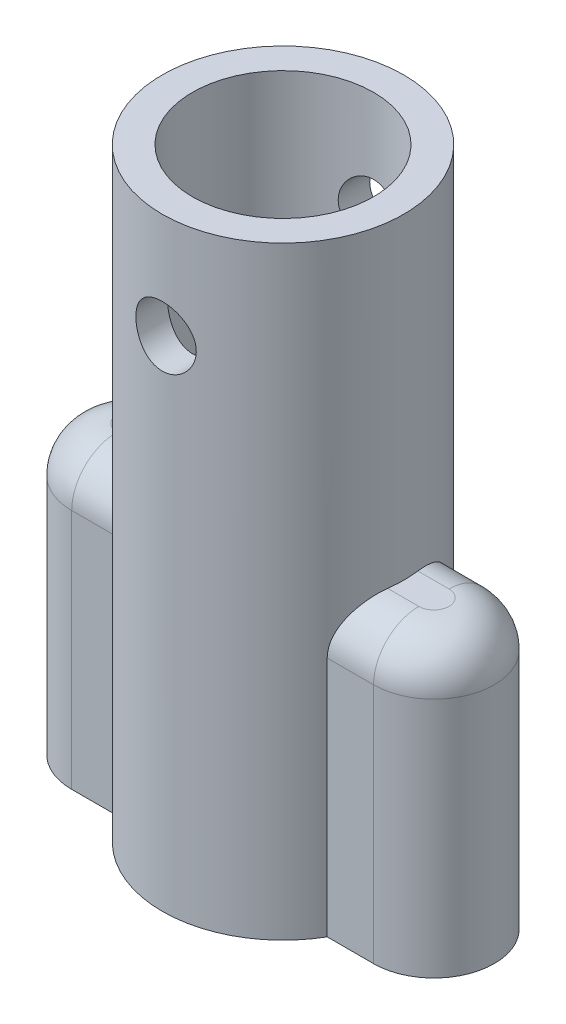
ISO-10303-21;
HEADER;
FILE_DESCRIPTION(('STEP AP214'),'2;1');
FILE_NAME('part.step','',(''),(''),'','','');
FILE_SCHEMA(('AUTOMOTIVE_DESIGN { 1 0 10303 214 1 1 1 1 }'));
ENDSEC;
DATA;
#1=APPLICATION_CONTEXT('core data for automotive mechanical design processes');
#2=APPLICATION_PROTOCOL_DEFINITION('international standard','automotive_design',2000,#1);
#3=PRODUCT_CONTEXT('',#1,'mechanical');
#4=PRODUCT('Part','Part','',(#3));
#5=PRODUCT_RELATED_PRODUCT_CATEGORY('part','',(#4));
#6=PRODUCT_DEFINITION_FORMATION('','',#4);
#7=PRODUCT_DEFINITION_CONTEXT('part definition',#1,'design');
#8=PRODUCT_DEFINITION('design','',#6,#7);
#9=PRODUCT_DEFINITION_SHAPE('','',#8);
#10=(LENGTH_UNIT() NAMED_UNIT(*) SI_UNIT(.MILLI.,.METRE.));
#11=(NAMED_UNIT(*) PLANE_ANGLE_UNIT() SI_UNIT($,.RADIAN.));
#12=(NAMED_UNIT(*) SI_UNIT($,.STERADIAN.) SOLID_ANGLE_UNIT());
#13=UNCERTAINTY_MEASURE_WITH_UNIT(LENGTH_MEASURE(1.E-05),#10,'distance_accuracy_value','');
#14=(GEOMETRIC_REPRESENTATION_CONTEXT(3) GLOBAL_UNCERTAINTY_ASSIGNED_CONTEXT((#13)) GLOBAL_UNIT_ASSIGNED_CONTEXT((#10,
#11,#12)) REPRESENTATION_CONTEXT('',''));
#15=CARTESIAN_POINT('',(0.,0.,0.));
#16=DIRECTION('',(0.,0.,1.));
#17=DIRECTION('',(1.,0.,0.));
#18=AXIS2_PLACEMENT_3D('',#15,#16,#17);
#19=CARTESIAN_POINT('',(0.,16.,0.));
#20=DIRECTION('',(0.,1.,0.));
#21=DIRECTION('',(0.,0.,1.));
#22=AXIS2_PLACEMENT_3D('',#19,#20,#21);
#23=PLANE('',#22);
#24=CARTESIAN_POINT('',(-10.5,16.,0.));
#25=DIRECTION('',(0.,1.,0.));
#26=DIRECTION('',(0.,0.,1.));
#27=AXIS2_PLACEMENT_3D('',#24,#25,#26);
#28=CIRCLE('',#27,1.65);
#29=CARTESIAN_POINT('',(-10.5,16.,1.65));
#30=VERTEX_POINT('',#29);
#31=EDGE_CURVE('E20',#30,#30,#28,.F.);
#32=ORIENTED_EDGE('',*,*,#31,.T.);
#33=EDGE_LOOP('',(#32));
#34=FACE_BOUND('',#33,.T.);
#35=ADVANCED_FACE('F16',(#34),#23,.F.);
#36=CARTESIAN_POINT('',(0.,16.,0.));
#37=DIRECTION('',(0.,1.,0.));
#38=DIRECTION('',(0.,0.,1.));
#39=AXIS2_PLACEMENT_3D('',#36,#37,#38);
#40=PLANE('',#39);
#41=CARTESIAN_POINT('',(10.5,16.,0.));
#42=DIRECTION('',(0.,1.,0.));
#43=DIRECTION('',(0.,0.,1.));
#44=AXIS2_PLACEMENT_3D('',#41,#42,#43);
#45=CIRCLE('',#44,1.65);
#46=CARTESIAN_POINT('',(10.5,16.,1.65));
#47=VERTEX_POINT('',#46);
#48=EDGE_CURVE('E154',#47,#47,#45,.F.);
#49=ORIENTED_EDGE('',*,*,#48,.T.);
#50=EDGE_LOOP('',(#49));
#51=FACE_BOUND('',#50,.T.);
#52=ADVANCED_FACE('F385',(#51),#40,.F.);
#53=CARTESIAN_POINT('',(10.0000000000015,16.0000000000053,7.55038392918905E-13));
#54=DIRECTION('',(0.,1.,0.));
#55=DIRECTION('',(0.,0.,1.));
#56=AXIS2_PLACEMENT_3D('',#53,#54,#55);
#57=DEGENERATE_TOROIDAL_SURFACE('',#56,1.00000000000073,2.99999999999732,.T.);
#58=CARTESIAN_POINT('',(10.,16.,0.));
#59=DIRECTION('',(0.,1.,0.));
#60=DIRECTION('',(0.,0.,1.));
#61=AXIS2_PLACEMENT_3D('',#58,#59,#60);
#62=CIRCLE('',#61,4.);
#63=CARTESIAN_POINT('',(9.99999999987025,16.,-4.));
#64=VERTEX_POINT('',#63);
#65=CARTESIAN_POINT('',(10.,16.,4.));
#66=VERTEX_POINT('',#65);
#67=EDGE_CURVE('E107',#64,#66,#62,.F.);
#68=ORIENTED_EDGE('',*,*,#67,.F.);
#69=CARTESIAN_POINT('',(10.,16.,-1.));
#70=DIRECTION('',(-1.,0.,0.));
#71=DIRECTION('',(0.,0.,1.));
#72=AXIS2_PLACEMENT_3D('',#69,#70,#71);
#73=CIRCLE('',#72,3.);
#74=CARTESIAN_POINT('',(10.0000000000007,19.0000000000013,-1.));
#75=VERTEX_POINT('',#74);
#76=EDGE_CURVE('E119',#75,#64,#73,.T.);
#77=ORIENTED_EDGE('',*,*,#76,.F.);
#78=CARTESIAN_POINT('',(10.0000000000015,19.0000000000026,7.5926825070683E-13));
#79=DIRECTION('',(0.,1.,0.));
#80=DIRECTION('',(0.,0.,1.));
#81=AXIS2_PLACEMENT_3D('',#78,#79,#80);
#82=CIRCLE('',#81,1.00000000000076);
#83=CARTESIAN_POINT('',(10.0000000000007,19.0000000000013,1.));
#84=VERTEX_POINT('',#83);
#85=EDGE_CURVE('E293',#84,#75,#82,.T.);
#86=ORIENTED_EDGE('',*,*,#85,.F.);
#87=CARTESIAN_POINT('',(10.,16.,1.));
#88=DIRECTION('',(1.,0.,0.));
#89=DIRECTION('',(0.,0.,-1.));
#90=AXIS2_PLACEMENT_3D('',#87,#88,#89);
#91=CIRCLE('',#90,3.);
#92=EDGE_CURVE('E100',#66,#84,#91,.F.);
#93=ORIENTED_EDGE('',*,*,#92,.F.);
#94=EDGE_LOOP('',(#68,#77,#86,#93));
#95=FACE_BOUND('',#94,.T.);
#96=ADVANCED_FACE('F118',(#95),#57,.T.);
#97=CARTESIAN_POINT('',(-10.0000000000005,16.0000000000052,3.31765864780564E-13));
#98=DIRECTION('',(0.,1.,0.));
#99=DIRECTION('',(0.,0.,1.));
#100=AXIS2_PLACEMENT_3D('',#97,#98,#99);
#101=DEGENERATE_TOROIDAL_SURFACE('',#100,1.00000000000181,2.99999999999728,.T.);
#102=CARTESIAN_POINT('',(-10.,16.,0.));
#103=DIRECTION('',(0.,1.,0.));
#104=DIRECTION('',(0.,0.,1.));
#105=AXIS2_PLACEMENT_3D('',#102,#103,#104);
#106=CIRCLE('',#105,4.);
#107=CARTESIAN_POINT('',(-10.,16.,4.));
#108=VERTEX_POINT('',#107);
#109=CARTESIAN_POINT('',(-10.,16.,-4.));
#110=VERTEX_POINT('',#109);
#111=EDGE_CURVE('E113',#108,#110,#106,.F.);
#112=ORIENTED_EDGE('',*,*,#111,.F.);
#113=CARTESIAN_POINT('',(-10.,16.,1.));
#114=DIRECTION('',(1.,0.,0.));
#115=DIRECTION('',(0.,0.,-1.));
#116=AXIS2_PLACEMENT_3D('',#113,#114,#115);
#117=CIRCLE('',#116,3.);
#118=CARTESIAN_POINT('',(-10.0000000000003,19.0000000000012,1.));
#119=VERTEX_POINT('',#118);
#120=EDGE_CURVE('E163',#119,#108,#117,.T.);
#121=ORIENTED_EDGE('',*,*,#120,.F.);
#122=CARTESIAN_POINT('',(-10.0000000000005,19.0000000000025,3.27536006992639E-13));
#123=DIRECTION('',(0.,1.,0.));
#124=DIRECTION('',(0.,0.,1.));
#125=AXIS2_PLACEMENT_3D('',#122,#123,#124);
#126=CIRCLE('',#125,0.999999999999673);
#127=CARTESIAN_POINT('',(-10.0000000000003,19.0000000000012,-1.));
#128=VERTEX_POINT('',#127);
#129=EDGE_CURVE('E291',#128,#119,#126,.T.);
#130=ORIENTED_EDGE('',*,*,#129,.F.);
#131=CARTESIAN_POINT('',(-10.,16.,-1.));
#132=DIRECTION('',(-1.,0.,0.));
#133=DIRECTION('',(0.,0.,1.));
#134=AXIS2_PLACEMENT_3D('',#131,#132,#133);
#135=CIRCLE('',#134,3.);
#136=EDGE_CURVE('E167',#110,#128,#135,.F.);
#137=ORIENTED_EDGE('',*,*,#136,.F.);
#138=EDGE_LOOP('',(#112,#121,#130,#137));
#139=FACE_BOUND('',#138,.T.);
#140=ADVANCED_FACE('F18',(#139),#101,.T.);
#141=CARTESIAN_POINT('',(10.,0.,0.));
#142=DIRECTION('',(0.,1.,0.));
#143=DIRECTION('',(0.,0.,1.));
#144=AXIS2_PLACEMENT_3D('',#141,#142,#143);
#145=CYLINDRICAL_SURFACE('',#144,4.);
#146=CARTESIAN_POINT('',(10.,0.,0.));
#147=DIRECTION('',(0.,1.,0.));
#148=DIRECTION('',(0.,0.,1.));
#149=AXIS2_PLACEMENT_3D('',#146,#147,#148);
#150=CIRCLE('',#149,4.);
#151=CARTESIAN_POINT('',(10.,0.,4.));
#152=VERTEX_POINT('',#151);
#153=CARTESIAN_POINT('',(9.9999999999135,0.,-4.));
#154=VERTEX_POINT('',#153);
#155=EDGE_CURVE('E134',#152,#154,#150,.T.);
#156=ORIENTED_EDGE('',*,*,#155,.T.);
#157=DIRECTION('',(0.,1.,0.));
#158=VECTOR('',#157,1.);
#159=CARTESIAN_POINT('',(9.999999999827,0.,-4.));
#160=LINE('',#159,#158);
#161=EDGE_CURVE('E131',#64,#154,#160,.F.);
#162=ORIENTED_EDGE('',*,*,#161,.F.);
#163=ORIENTED_EDGE('',*,*,#67,.T.);
#164=DIRECTION('',(0.,1.,0.));
#165=VECTOR('',#164,1.);
#166=CARTESIAN_POINT('',(10.,0.,4.));
#167=LINE('',#166,#165);
#168=EDGE_CURVE('E151',#152,#66,#167,.T.);
#169=ORIENTED_EDGE('',*,*,#168,.F.);
#170=EDGE_LOOP('',(#156,#162,#163,#169));
#171=FACE_BOUND('',#170,.T.);
#172=ADVANCED_FACE('F132',(#171),#145,.T.);
#173=CARTESIAN_POINT('',(-10.,0.,0.));
#174=DIRECTION('',(0.,1.,0.));
#175=DIRECTION('',(0.,0.,1.));
#176=AXIS2_PLACEMENT_3D('',#173,#174,#175);
#177=CYLINDRICAL_SURFACE('',#176,4.);
#178=CARTESIAN_POINT('',(-10.,0.,0.));
#179=DIRECTION('',(0.,1.,0.));
#180=DIRECTION('',(0.,0.,1.));
#181=AXIS2_PLACEMENT_3D('',#178,#179,#180);
#182=CIRCLE('',#181,4.);
#183=CARTESIAN_POINT('',(-10.,0.,-4.));
#184=VERTEX_POINT('',#183);
#185=CARTESIAN_POINT('',(-10.,0.,4.));
#186=VERTEX_POINT('',#185);
#187=EDGE_CURVE('E284',#184,#186,#182,.T.);
#188=ORIENTED_EDGE('',*,*,#187,.T.);
#189=DIRECTION('',(0.,1.,0.));
#190=VECTOR('',#189,1.);
#191=CARTESIAN_POINT('',(-10.,0.,4.));
#192=LINE('',#191,#190);
#193=EDGE_CURVE('E289',#108,#186,#192,.F.);
#194=ORIENTED_EDGE('',*,*,#193,.F.);
#195=ORIENTED_EDGE('',*,*,#111,.T.);
#196=DIRECTION('',(0.,1.,0.));
#197=VECTOR('',#196,1.);
#198=CARTESIAN_POINT('',(-10.,0.,-4.));
#199=LINE('',#198,#197);
#200=EDGE_CURVE('E138',#184,#110,#199,.T.);
#201=ORIENTED_EDGE('',*,*,#200,.F.);
#202=EDGE_LOOP('',(#188,#194,#195,#201));
#203=FACE_BOUND('',#202,.T.);
#204=ADVANCED_FACE('F374',(#203),#177,.T.);
#205=CARTESIAN_POINT('',(-10.5,0.,0.));
#206=DIRECTION('',(0.,1.,0.));
#207=DIRECTION('',(0.,0.,1.));
#208=AXIS2_PLACEMENT_3D('',#205,#206,#207);
#209=CYLINDRICAL_SURFACE('',#208,1.65);
#210=ORIENTED_EDGE('',*,*,#31,.F.);
#211=EDGE_LOOP('',(#210));
#212=FACE_BOUND('',#211,.T.);
#213=CARTESIAN_POINT('',(-10.5,0.,0.));
#214=DIRECTION('',(0.,1.,0.));
#215=DIRECTION('',(0.,0.,1.));
#216=AXIS2_PLACEMENT_3D('',#213,#214,#215);
#217=CIRCLE('',#216,1.65);
#218=CARTESIAN_POINT('',(-10.5,0.,1.65));
#219=VERTEX_POINT('',#218);
#220=EDGE_CURVE('E277',#219,#219,#217,.F.);
#221=ORIENTED_EDGE('',*,*,#220,.T.);
#222=EDGE_LOOP('',(#221));
#223=FACE_BOUND('',#222,.T.);
#224=ADVANCED_FACE('F372',(#212,#223),#209,.F.);
#225=CARTESIAN_POINT('',(10.5,0.,0.));
#226=DIRECTION('',(0.,1.,0.));
#227=DIRECTION('',(0.,0.,1.));
#228=AXIS2_PLACEMENT_3D('',#225,#226,#227);
#229=CYLINDRICAL_SURFACE('',#228,1.65);
#230=ORIENTED_EDGE('',*,*,#48,.F.);
#231=EDGE_LOOP('',(#230));
#232=FACE_BOUND('',#231,.T.);
#233=CARTESIAN_POINT('',(10.5,0.,0.));
#234=DIRECTION('',(0.,1.,0.));
#235=DIRECTION('',(0.,0.,1.));
#236=AXIS2_PLACEMENT_3D('',#233,#234,#235);
#237=CIRCLE('',#236,1.65);
#238=CARTESIAN_POINT('',(10.5,0.,1.65));
#239=VERTEX_POINT('',#238);
#240=EDGE_CURVE('E275',#239,#239,#237,.F.);
#241=ORIENTED_EDGE('',*,*,#240,.T.);
#242=EDGE_LOOP('',(#241));
#243=FACE_BOUND('',#242,.T.);
#244=ADVANCED_FACE('F253',(#232,#243),#229,.F.);
#245=CARTESIAN_POINT('',(0.,0.,0.));
#246=DIRECTION('',(0.,1.,0.));
#247=DIRECTION('',(0.,0.,1.));
#248=AXIS2_PLACEMENT_3D('',#245,#246,#247);
#249=CYLINDRICAL_SURFACE('',#248,6.);
#250=CARTESIAN_POINT('',(0.,31.,6.));
#251=CARTESIAN_POINT('',(0.109051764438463,31.0000045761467,5.99999668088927));
#252=CARTESIAN_POINT('',(0.218157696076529,31.0089549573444,5.99699676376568));
#253=CARTESIAN_POINT('',(0.433211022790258,31.0444365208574,5.985311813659));
#254=CARTESIAN_POINT('',(0.539155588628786,31.0709829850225,5.97662183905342));
#255=CARTESIAN_POINT('',(0.744671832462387,31.1406417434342,5.95450498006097));
#256=CARTESIAN_POINT('',(0.844255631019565,31.1837213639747,5.94108744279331));
#257=CARTESIAN_POINT('',(1.03476566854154,31.2850920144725,5.91088618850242));
#258=CARTESIAN_POINT('',(1.12569163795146,31.343383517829,5.894102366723));
#259=CARTESIAN_POINT('',(1.29947472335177,31.4756450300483,5.85828360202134));
#260=CARTESIAN_POINT('',(1.38199150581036,31.5500475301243,5.83919475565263));
#261=CARTESIAN_POINT('',(1.53365228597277,31.7115183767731,5.80120993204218));
#262=CARTESIAN_POINT('',(1.60279077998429,31.7985919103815,5.78231403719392));
#263=CARTESIAN_POINT('',(1.72767937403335,31.9860121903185,5.74625797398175));
#264=CARTESIAN_POINT('',(1.78298064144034,32.0866717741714,5.72916442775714));
#265=CARTESIAN_POINT('',(1.87567434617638,32.2964659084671,5.69949444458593));
#266=CARTESIAN_POINT('',(1.91308899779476,32.4055897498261,5.68691240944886));
#267=CARTESIAN_POINT('',(1.96045323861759,32.5960032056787,5.6707175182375));
#268=CARTESIAN_POINT('',(1.9752520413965,32.6759867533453,5.6655528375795));
#269=CARTESIAN_POINT('',(1.99502673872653,32.8373034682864,5.65861982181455));
#270=CARTESIAN_POINT('',(2.00000352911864,32.9186365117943,5.65685117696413));
#271=CARTESIAN_POINT('',(1.99999527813,33.1088622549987,5.65685836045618));
#272=CARTESIAN_POINT('',(1.9910749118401,33.2177790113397,5.66003415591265));
#273=CARTESIAN_POINT('',(1.95572343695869,33.4324385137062,5.67234347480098));
#274=CARTESIAN_POINT('',(1.92927636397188,33.5381782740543,5.68148242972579));
#275=CARTESIAN_POINT('',(1.85990780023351,33.7432597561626,5.7045653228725));
#276=CARTESIAN_POINT('',(1.81702344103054,33.8426153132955,5.71849842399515));
#277=CARTESIAN_POINT('',(1.71611391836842,34.032735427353,5.74958512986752));
#278=CARTESIAN_POINT('',(1.65808785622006,34.123499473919,5.76673892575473));
#279=CARTESIAN_POINT('',(1.5261088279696,34.2974313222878,5.80308805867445));
#280=CARTESIAN_POINT('',(1.45166352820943,34.3802150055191,5.82233425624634));
#281=CARTESIAN_POINT('',(1.28999121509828,34.5324005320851,5.86027372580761));
#282=CARTESIAN_POINT('',(1.20275973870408,34.601797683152,5.87896680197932));
#283=CARTESIAN_POINT('',(1.01516764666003,34.726986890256,5.91428567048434));
#284=CARTESIAN_POINT('',(0.914520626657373,34.7823702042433,5.93084364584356));
#285=CARTESIAN_POINT('',(0.704750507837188,34.8752193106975,5.95940282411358));
#286=CARTESIAN_POINT('',(0.595637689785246,34.9127064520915,5.97140945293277));
#287=CARTESIAN_POINT('',(0.405039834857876,34.9602477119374,5.98683882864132));
#288=CARTESIAN_POINT('',(0.324845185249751,34.9751241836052,5.99174666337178));
#289=CARTESIAN_POINT('',(0.163110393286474,34.995001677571,5.99832837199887));
#290=CARTESIAN_POINT('',(0.0815703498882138,35.0000034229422,6.00000248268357));
#291=CARTESIAN_POINT('',(-0.109051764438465,34.9999954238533,5.99999668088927));
#292=CARTESIAN_POINT('',(-0.218157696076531,34.9910450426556,5.99699676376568));
#293=CARTESIAN_POINT('',(-0.433211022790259,34.9555634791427,5.985311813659));
#294=CARTESIAN_POINT('',(-0.539155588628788,34.9290170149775,5.97662183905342));
#295=CARTESIAN_POINT('',(-0.744671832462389,34.8593582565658,5.95450498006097));
#296=CARTESIAN_POINT('',(-0.844255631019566,34.8162786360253,5.94108744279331));
#297=CARTESIAN_POINT('',(-1.03476566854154,34.7149079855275,5.91088618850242));
#298=CARTESIAN_POINT('',(-1.12569163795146,34.656616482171,5.894102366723));
#299=CARTESIAN_POINT('',(-1.29947472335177,34.5243549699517,5.85828360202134));
#300=CARTESIAN_POINT('',(-1.38199150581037,34.4499524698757,5.83919475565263));
#301=CARTESIAN_POINT('',(-1.53365228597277,34.2884816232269,5.80120993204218));
#302=CARTESIAN_POINT('',(-1.60279077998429,34.2014080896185,5.78231403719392));
#303=CARTESIAN_POINT('',(-1.72767937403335,34.0139878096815,5.74625797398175));
#304=CARTESIAN_POINT('',(-1.78298064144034,33.9133282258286,5.72916442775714));
#305=CARTESIAN_POINT('',(-1.87567434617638,33.7035340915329,5.69949444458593));
#306=CARTESIAN_POINT('',(-1.91308899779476,33.5944102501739,5.68691240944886));
#307=CARTESIAN_POINT('',(-1.96045323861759,33.4039967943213,5.6707175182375));
#308=CARTESIAN_POINT('',(-1.9752520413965,33.3240132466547,5.6655528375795));
#309=CARTESIAN_POINT('',(-1.99502673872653,33.1626965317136,5.65861982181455));
#310=CARTESIAN_POINT('',(-2.00000352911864,33.0813634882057,5.65685117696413));
#311=CARTESIAN_POINT('',(-1.99999527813,32.8911377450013,5.65685836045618));
#312=CARTESIAN_POINT('',(-1.9910749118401,32.7822209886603,5.66003415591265));
#313=CARTESIAN_POINT('',(-1.95572343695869,32.5675614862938,5.67234347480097));
#314=CARTESIAN_POINT('',(-1.92927636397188,32.4618217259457,5.68148242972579));
#315=CARTESIAN_POINT('',(-1.85990780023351,32.2567402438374,5.7045653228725));
#316=CARTESIAN_POINT('',(-1.81702344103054,32.1573846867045,5.71849842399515));
#317=CARTESIAN_POINT('',(-1.71611391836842,31.967264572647,5.74958512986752));
#318=CARTESIAN_POINT('',(-1.65808785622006,31.876500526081,5.76673892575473));
#319=CARTESIAN_POINT('',(-1.5261088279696,31.7025686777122,5.80308805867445));
#320=CARTESIAN_POINT('',(-1.45166352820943,31.6197849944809,5.82233425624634));
#321=CARTESIAN_POINT('',(-1.28999121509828,31.4675994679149,5.86027372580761));
#322=CARTESIAN_POINT('',(-1.20275973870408,31.398202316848,5.87896680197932));
#323=CARTESIAN_POINT('',(-1.01516764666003,31.273013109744,5.91428567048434));
#324=CARTESIAN_POINT('',(-0.914520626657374,31.2176297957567,5.93084364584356));
#325=CARTESIAN_POINT('',(-0.704750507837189,31.1247806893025,5.95940282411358));
#326=CARTESIAN_POINT('',(-0.595637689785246,31.0872935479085,5.97140945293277));
#327=CARTESIAN_POINT('',(-0.405039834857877,31.0397522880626,5.98683882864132));
#328=CARTESIAN_POINT('',(-0.324845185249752,31.0248758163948,5.99174666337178));
#329=CARTESIAN_POINT('',(-0.163110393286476,31.004998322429,5.99832837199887));
#330=CARTESIAN_POINT('',(-0.0815703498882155,30.9999965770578,6.00000248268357));
#331=CARTESIAN_POINT('',(0.,31.,6.));
#332=B_SPLINE_CURVE_WITH_KNOTS('',3,(#250,#251,#252,#253,#254,#255,#256,#257,#258,#259,#260,
#261,#262,#263,#264,#265,#266,#267,#268,#269,#270,#271,#272,#273,#274,#275,#276,#277,#278,#279,
#280,#281,#282,#283,#284,#285,#286,#287,#288,#289,#290,#291,#292,#293,#294,#295,#296,#297,#298,
#299,#300,#301,#302,#303,#304,#305,#306,#307,#308,#309,#310,#311,#312,#313,#314,#315,#316,#317,
#318,#319,#320,#321,#322,#323,#324,#325,#326,#327,#328,#329,#330,#331),.UNSPECIFIED.,.T.,.F.,(4,
2,2,2,2,2,2,2,2,2,2,2,2,2,2,2,2,2,2,2,2,2,2,2,2,2,2,2,2,2,2,2,2,2,2,2,2,2,2,2,4),(0.,
0.326849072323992,0.653982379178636,0.980472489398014,1.30697276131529,1.64366160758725,
1.98048867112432,2.32713061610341,2.67334092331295,2.91722380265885,3.16108443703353,
3.48736369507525,3.81394055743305,4.13978399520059,4.46564677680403,4.80307923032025,
5.14062974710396,5.4871150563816,5.83318599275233,6.07768589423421,6.32216789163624,
6.64901696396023,6.97615027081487,7.30264038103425,7.62914065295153,7.96582949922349,
8.30265656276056,8.64929850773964,8.99550881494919,9.23939169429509,9.48325232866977,
9.80953158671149,10.1361084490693,10.4619518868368,10.7878146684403,11.1252471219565,
11.4627976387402,11.8092829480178,12.1553538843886,12.3998537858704,12.6443357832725),.UNSPECIFIED.);
#333=CARTESIAN_POINT('',(0.,31.,6.));
#334=VERTEX_POINT('',#333);
#335=EDGE_CURVE('E237',#334,#334,#332,.T.);
#336=ORIENTED_EDGE('',*,*,#335,.T.);
#337=EDGE_LOOP('',(#336));
#338=FACE_BOUND('',#337,.T.);
#339=CARTESIAN_POINT('',(0.,40.,0.));
#340=DIRECTION('',(0.,1.,0.));
#341=DIRECTION('',(0.,0.,1.));
#342=AXIS2_PLACEMENT_3D('',#339,#340,#341);
#343=CIRCLE('',#342,6.);
#344=CARTESIAN_POINT('',(0.,40.,6.));
#345=VERTEX_POINT('',#344);
#346=EDGE_CURVE('E244',#345,#345,#343,.F.);
#347=ORIENTED_EDGE('',*,*,#346,.F.);
#348=EDGE_LOOP('',(#347));
#349=FACE_BOUND('',#348,.T.);
#350=CARTESIAN_POINT('',(2.,33.,-5.65685424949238));
#351=CARTESIAN_POINT('',(1.99999527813,32.8911377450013,-5.65685836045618));
#352=CARTESIAN_POINT('',(1.9910749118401,32.7822209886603,-5.66003415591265));
#353=CARTESIAN_POINT('',(1.95572343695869,32.5675614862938,-5.67234347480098));
#354=CARTESIAN_POINT('',(1.92927636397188,32.4618217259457,-5.68148242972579));
#355=CARTESIAN_POINT('',(1.85990780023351,32.2567402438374,-5.7045653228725));
#356=CARTESIAN_POINT('',(1.81702344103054,32.1573846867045,-5.71849842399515));
#357=CARTESIAN_POINT('',(1.71611391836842,31.967264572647,-5.74958512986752));
#358=CARTESIAN_POINT('',(1.65808785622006,31.876500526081,-5.76673892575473));
#359=CARTESIAN_POINT('',(1.5261088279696,31.7025686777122,-5.80308805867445));
#360=CARTESIAN_POINT('',(1.45166352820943,31.6197849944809,-5.82233425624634));
#361=CARTESIAN_POINT('',(1.28999121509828,31.4675994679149,-5.86027372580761));
#362=CARTESIAN_POINT('',(1.20275973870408,31.398202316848,-5.87896680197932));
#363=CARTESIAN_POINT('',(1.01516764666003,31.273013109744,-5.91428567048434));
#364=CARTESIAN_POINT('',(0.914520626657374,31.2176297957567,-5.93084364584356));
#365=CARTESIAN_POINT('',(0.704750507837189,31.1247806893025,-5.95940282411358));
#366=CARTESIAN_POINT('',(0.595637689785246,31.0872935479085,-5.97140945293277));
#367=CARTESIAN_POINT('',(0.405039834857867,31.0397522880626,-5.98683882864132));
#368=CARTESIAN_POINT('',(0.324845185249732,31.0248758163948,-5.99174666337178));
#369=CARTESIAN_POINT('',(0.163110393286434,31.004998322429,-5.99832837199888));
#370=CARTESIAN_POINT('',(0.0815703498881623,30.9999965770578,-6.00000248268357));
#371=CARTESIAN_POINT('',(-0.109051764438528,31.0000045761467,-5.99999668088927));
#372=CARTESIAN_POINT('',(-0.218157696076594,31.0089549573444,-5.99699676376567));
#373=CARTESIAN_POINT('',(-0.433211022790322,31.0444365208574,-5.985311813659));
#374=CARTESIAN_POINT('',(-0.53915558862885,31.0709829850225,-5.97662183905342));
#375=CARTESIAN_POINT('',(-0.74467183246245,31.1406417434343,-5.95450498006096));
#376=CARTESIAN_POINT('',(-0.844255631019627,31.1837213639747,-5.9410874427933));
#377=CARTESIAN_POINT('',(-1.0347656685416,31.2850920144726,-5.91088618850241));
#378=CARTESIAN_POINT('',(-1.12569163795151,31.3433835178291,-5.89410236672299));
#379=CARTESIAN_POINT('',(-1.29947472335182,31.4756450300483,-5.85828360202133));
#380=CARTESIAN_POINT('',(-1.38199150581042,31.5500475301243,-5.83919475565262));
#381=CARTESIAN_POINT('',(-1.53365228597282,31.7115183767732,-5.80120993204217));
#382=CARTESIAN_POINT('',(-1.60279077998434,31.7985919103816,-5.78231403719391));
#383=CARTESIAN_POINT('',(-1.72767937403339,31.9860121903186,-5.74625797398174));
#384=CARTESIAN_POINT('',(-1.78298064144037,32.0866717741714,-5.72916442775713));
#385=CARTESIAN_POINT('',(-1.87567434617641,32.2964659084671,-5.69949444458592));
#386=CARTESIAN_POINT('',(-1.91308899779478,32.4055897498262,-5.68691240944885));
#387=CARTESIAN_POINT('',(-1.9604532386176,32.5960032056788,-5.6707175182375));
#388=CARTESIAN_POINT('',(-1.97525204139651,32.6759867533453,-5.6655528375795));
#389=CARTESIAN_POINT('',(-1.99502673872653,32.8373034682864,-5.65861982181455));
#390=CARTESIAN_POINT('',(-2.00000352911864,32.9186365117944,-5.65685117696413));
#391=CARTESIAN_POINT('',(-1.99999527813,33.1088622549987,-5.65685836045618));
#392=CARTESIAN_POINT('',(-1.9910749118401,33.2177790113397,-5.66003415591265));
#393=CARTESIAN_POINT('',(-1.95572343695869,33.4324385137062,-5.67234347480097));
#394=CARTESIAN_POINT('',(-1.92927636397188,33.5381782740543,-5.68148242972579));
#395=CARTESIAN_POINT('',(-1.85990780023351,33.7432597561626,-5.7045653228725));
#396=CARTESIAN_POINT('',(-1.81702344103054,33.8426153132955,-5.71849842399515));
#397=CARTESIAN_POINT('',(-1.71611391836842,34.032735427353,-5.74958512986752));
#398=CARTESIAN_POINT('',(-1.65808785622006,34.123499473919,-5.76673892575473));
#399=CARTESIAN_POINT('',(-1.5261088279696,34.2974313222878,-5.80308805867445));
#400=CARTESIAN_POINT('',(-1.45166352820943,34.3802150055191,-5.82233425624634));
#401=CARTESIAN_POINT('',(-1.28999121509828,34.5324005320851,-5.86027372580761));
#402=CARTESIAN_POINT('',(-1.20275973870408,34.601797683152,-5.87896680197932));
#403=CARTESIAN_POINT('',(-1.01516764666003,34.726986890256,-5.91428567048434));
#404=CARTESIAN_POINT('',(-0.914520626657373,34.7823702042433,-5.93084364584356));
#405=CARTESIAN_POINT('',(-0.704750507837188,34.8752193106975,-5.95940282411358));
#406=CARTESIAN_POINT('',(-0.595637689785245,34.9127064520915,-5.97140945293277));
#407=CARTESIAN_POINT('',(-0.405039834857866,34.9602477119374,-5.98683882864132));
#408=CARTESIAN_POINT('',(-0.324845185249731,34.9751241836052,-5.99174666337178));
#409=CARTESIAN_POINT('',(-0.163110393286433,34.9950016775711,-5.99832837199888));
#410=CARTESIAN_POINT('',(-0.0815703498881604,35.0000034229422,-6.00000248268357));
#411=CARTESIAN_POINT('',(0.10905176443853,34.9999954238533,-5.99999668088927));
#412=CARTESIAN_POINT('',(0.218157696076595,34.9910450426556,-5.99699676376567));
#413=CARTESIAN_POINT('',(0.433211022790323,34.9555634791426,-5.985311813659));
#414=CARTESIAN_POINT('',(0.539155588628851,34.9290170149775,-5.97662183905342));
#415=CARTESIAN_POINT('',(0.744671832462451,34.8593582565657,-5.95450498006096));
#416=CARTESIAN_POINT('',(0.844255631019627,34.8162786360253,-5.9410874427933));
#417=CARTESIAN_POINT('',(1.0347656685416,34.7149079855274,-5.91088618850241));
#418=CARTESIAN_POINT('',(1.12569163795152,34.6566164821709,-5.89410236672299));
#419=CARTESIAN_POINT('',(1.29947472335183,34.5243549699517,-5.85828360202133));
#420=CARTESIAN_POINT('',(1.38199150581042,34.4499524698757,-5.83919475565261));
#421=CARTESIAN_POINT('',(1.53365228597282,34.2884816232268,-5.80120993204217));
#422=CARTESIAN_POINT('',(1.60279077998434,34.2014080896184,-5.78231403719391));
#423=CARTESIAN_POINT('',(1.72767937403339,34.0139878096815,-5.74625797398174));
#424=CARTESIAN_POINT('',(1.78298064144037,33.9133282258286,-5.72916442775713));
#425=CARTESIAN_POINT('',(1.87567434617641,33.7035340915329,-5.69949444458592));
#426=CARTESIAN_POINT('',(1.91308899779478,33.5944102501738,-5.68691240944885));
#427=CARTESIAN_POINT('',(1.9604532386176,33.4039967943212,-5.6707175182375));
#428=CARTESIAN_POINT('',(1.97525204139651,33.3240132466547,-5.6655528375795));
#429=CARTESIAN_POINT('',(1.99502673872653,33.1626965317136,-5.65861982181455));
#430=CARTESIAN_POINT('',(2.00000352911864,33.0813634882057,-5.65685117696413));
#431=CARTESIAN_POINT('',(2.,33.,-5.65685424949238));
#432=B_SPLINE_CURVE_WITH_KNOTS('',3,(#350,#351,#352,#353,#354,#355,#356,#357,#358,#359,#360,
#361,#362,#363,#364,#365,#366,#367,#368,#369,#370,#371,#372,#373,#374,#375,#376,#377,#378,#379,
#380,#381,#382,#383,#384,#385,#386,#387,#388,#389,#390,#391,#392,#393,#394,#395,#396,#397,#398,
#399,#400,#401,#402,#403,#404,#405,#406,#407,#408,#409,#410,#411,#412,#413,#414,#415,#416,#417,
#418,#419,#420,#421,#422,#423,#424,#425,#426,#427,#428,#429,#430,#431),.UNSPECIFIED.,.T.,.F.,(4,
2,2,2,2,2,2,2,2,2,2,2,2,2,2,2,2,2,2,2,2,2,2,2,2,2,2,2,2,2,2,2,2,2,2,2,2,2,2,2,4),(0.,
0.326279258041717,0.652856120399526,0.97869955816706,1.3045623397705,1.64199479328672,
1.97954531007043,2.32603061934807,2.6721015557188,2.91660145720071,3.16108345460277,
3.48793252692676,3.81506583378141,4.14155594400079,4.46805621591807,4.80474506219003,
5.14157212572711,5.48821407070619,5.83442437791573,6.0783072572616,6.32216789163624,
6.64844714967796,6.97502401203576,7.3008674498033,7.62673023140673,7.96416268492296,
8.30171320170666,8.64819851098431,8.99426944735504,9.23876934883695,9.48325134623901,
9.810100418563,10.1372337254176,10.463723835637,10.7902241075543,11.1269129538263,
11.4637400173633,11.8103819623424,12.156592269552,12.4004751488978,12.6443357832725),.UNSPECIFIED.);
#433=CARTESIAN_POINT('',(2.,33.,-5.65685424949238));
#434=VERTEX_POINT('',#433);
#435=EDGE_CURVE('E257',#434,#434,#432,.T.);
#436=ORIENTED_EDGE('',*,*,#435,.T.);
#437=EDGE_LOOP('',(#436));
#438=FACE_BOUND('',#437,.T.);
#439=CARTESIAN_POINT('',(0.,0.,0.));
#440=DIRECTION('',(0.,1.,0.));
#441=DIRECTION('',(0.,0.,1.));
#442=AXIS2_PLACEMENT_3D('',#439,#440,#441);
#443=CIRCLE('',#442,6.);
#444=CARTESIAN_POINT('',(0.,0.,6.));
#445=VERTEX_POINT('',#444);
#446=EDGE_CURVE('E245',#445,#445,#443,.F.);
#447=ORIENTED_EDGE('',*,*,#446,.T.);
#448=EDGE_LOOP('',(#447));
#449=FACE_BOUND('',#448,.T.);
#450=ADVANCED_FACE('F247',(#338,#349,#438,#449),#249,.F.);
#451=CARTESIAN_POINT('',(4.472135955,0.,4.));
#452=DIRECTION('',(0.,0.,1.));
#453=DIRECTION('',(1.,0.,0.));
#454=AXIS2_PLACEMENT_3D('',#451,#452,#453);
#455=PLANE('',#454);
#456=DIRECTION('',(1.,0.,0.));
#457=VECTOR('',#456,1.);
#458=CARTESIAN_POINT('',(0.,0.,4.));
#459=LINE('',#458,#457);
#460=CARTESIAN_POINT('',(6.92820323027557,0.,3.99999999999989));
#461=VERTEX_POINT('',#460);
#462=EDGE_CURVE('E281',#461,#152,#459,.T.);
#463=ORIENTED_EDGE('',*,*,#462,.T.);
#464=ORIENTED_EDGE('',*,*,#168,.T.);
#465=DIRECTION('',(1.,0.,0.));
#466=VECTOR('',#465,1.);
#467=CARTESIAN_POINT('',(-50.5008,16.,4.));
#468=LINE('',#467,#466);
#469=CARTESIAN_POINT('',(6.92820323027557,16.,3.99999999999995));
#470=VERTEX_POINT('',#469);
#471=EDGE_CURVE('E153',#470,#66,#468,.T.);
#472=ORIENTED_EDGE('',*,*,#471,.F.);
#473=DIRECTION('',(0.,1.,0.));
#474=VECTOR('',#473,1.);
#475=CARTESIAN_POINT('',(6.92820323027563,0.,3.99999999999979));
#476=LINE('',#475,#474);
#477=EDGE_CURVE('E261',#461,#470,#476,.T.);
#478=ORIENTED_EDGE('',*,*,#477,.F.);
#479=EDGE_LOOP('',(#463,#464,#472,#478));
#480=FACE_BOUND('',#479,.T.);
#481=ADVANCED_FACE('F252',(#480),#455,.T.);
#482=CARTESIAN_POINT('',(-50.5008,16.,1.));
#483=DIRECTION('',(1.,0.,0.));
#484=DIRECTION('',(0.,0.,-1.));
#485=AXIS2_PLACEMENT_3D('',#482,#483,#484);
#486=CYLINDRICAL_SURFACE('',#485,3.);
#487=ORIENTED_EDGE('',*,*,#471,.T.);
#488=ORIENTED_EDGE('',*,*,#92,.T.);
#489=DIRECTION('',(1.,0.,0.));
#490=VECTOR('',#489,1.);
#491=CARTESIAN_POINT('',(0.,19.,1.));
#492=LINE('',#491,#490);
#493=CARTESIAN_POINT('',(7.93725393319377,19.,1.));
#494=VERTEX_POINT('',#493);
#495=EDGE_CURVE('E177',#494,#84,#492,.T.);
#496=ORIENTED_EDGE('',*,*,#495,.F.);
#497=CARTESIAN_POINT('',(6.92820323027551,16.,4.));
#498=CARTESIAN_POINT('',(6.92818424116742,16.078052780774,4.0000139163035));
#499=CARTESIAN_POINT('',(6.92996140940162,16.1560941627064,3.99695433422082));
#500=CARTESIAN_POINT('',(6.93696495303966,16.3115080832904,3.98479692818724));
#501=CARTESIAN_POINT('',(6.94218945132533,16.3888809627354,3.97570239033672));
#502=CARTESIAN_POINT('',(6.95590706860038,16.541976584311,3.95164983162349));
#503=CARTESIAN_POINT('',(6.96438208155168,16.6177060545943,3.93672428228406));
#504=CARTESIAN_POINT('',(6.98433825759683,16.7674051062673,3.90120917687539));
#505=CARTESIAN_POINT('',(6.99581970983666,16.8413745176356,3.88061907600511));
#506=CARTESIAN_POINT('',(7.03426514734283,17.0596410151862,3.81076845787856));
#507=CARTESIAN_POINT('',(7.06527042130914,17.2007148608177,3.75336042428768));
#508=CARTESIAN_POINT('',(7.13507095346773,17.4711307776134,3.61890549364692));
#509=CARTESIAN_POINT('',(7.17387697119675,17.6004562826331,3.54183143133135));
#510=CARTESIAN_POINT('',(7.25926166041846,17.8545648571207,3.36356929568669));
#511=CARTESIAN_POINT('',(7.30620736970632,17.9782497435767,3.26099068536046));
#512=CARTESIAN_POINT('',(7.40177265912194,18.2074421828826,3.03784440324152));
#513=CARTESIAN_POINT('',(7.45039300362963,18.3129412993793,2.91726843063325));
#514=CARTESIAN_POINT('',(7.55041774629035,18.5126946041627,2.64832555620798));
#515=CARTESIAN_POINT('',(7.60165510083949,18.6049638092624,2.49841241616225));
#516=CARTESIAN_POINT('',(7.69806425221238,18.7623752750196,2.18331673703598));
#517=CARTESIAN_POINT('',(7.74324285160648,18.8275481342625,2.01815168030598));
#518=CARTESIAN_POINT('',(7.81603811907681,18.9178619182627,1.71146420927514));
#519=CARTESIAN_POINT('',(7.84535813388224,18.9484429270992,1.57194641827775));
#520=CARTESIAN_POINT('',(7.88397596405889,18.9792504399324,1.35946312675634));
#521=CARTESIAN_POINT('',(7.8959655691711,18.9870091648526,1.28801688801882));
#522=CARTESIAN_POINT('',(7.91805335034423,18.9973862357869,1.14443159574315));
#523=CARTESIAN_POINT('',(7.92815072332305,19.0000024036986,1.07229226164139));
#524=CARTESIAN_POINT('',(7.93725393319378,19.,0.999999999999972));
#525=B_SPLINE_CURVE_WITH_KNOTS('',3,(#497,#498,#499,#500,#501,#502,#503,#504,#505,#506,#507,
#508,#509,#510,#511,#512,#513,#514,#515,#516,#517,#518,#519,#520,#521,#522,#523,#524),
.UNSPECIFIED.,.F.,.F.,(4,2,2,2,2,2,2,2,2,2,2,2,2,4),(0.,0.234059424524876,0.467991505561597,
0.700639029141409,0.933308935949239,1.39738762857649,1.86211087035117,2.36226764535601,
2.86265582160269,3.41001234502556,3.95674907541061,4.39252604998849,4.61091756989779,
4.82940156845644),.UNSPECIFIED.);
#526=EDGE_CURVE('E214',#470,#494,#525,.T.);
#527=ORIENTED_EDGE('',*,*,#526,.F.);
#528=EDGE_LOOP('',(#487,#488,#496,#527));
#529=FACE_BOUND('',#528,.T.);
#530=ADVANCED_FACE('F436',(#529),#486,.T.);
#531=CARTESIAN_POINT('',(0.,19.,0.));
#532=DIRECTION('',(0.,1.,0.));
#533=DIRECTION('',(0.,0.,1.));
#534=AXIS2_PLACEMENT_3D('',#531,#532,#533);
#535=PLANE('',#534);
#536=ORIENTED_EDGE('',*,*,#495,.T.);
#537=ORIENTED_EDGE('',*,*,#85,.T.);
#538=DIRECTION('',(-1.,0.,0.));
#539=VECTOR('',#538,1.);
#540=CARTESIAN_POINT('',(10.07900978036,19.,-1.));
#541=LINE('',#540,#539);
#542=CARTESIAN_POINT('',(7.93725393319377,19.,-0.999999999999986));
#543=VERTEX_POINT('',#542);
#544=EDGE_CURVE('E128',#543,#75,#541,.F.);
#545=ORIENTED_EDGE('',*,*,#544,.F.);
#546=CARTESIAN_POINT('',(0.,19.,0.));
#547=DIRECTION('',(0.,1.,0.));
#548=DIRECTION('',(0.,0.,1.));
#549=AXIS2_PLACEMENT_3D('',#546,#547,#548);
#550=CIRCLE('',#549,8.);
#551=EDGE_CURVE('E516',#494,#543,#550,.T.);
#552=ORIENTED_EDGE('',*,*,#551,.F.);
#553=EDGE_LOOP('',(#536,#537,#545,#552));
#554=FACE_BOUND('',#553,.T.);
#555=ADVANCED_FACE('F443',(#554),#535,.T.);
#556=CARTESIAN_POINT('',(10.07900978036,16.,-1.));
#557=DIRECTION('',(-1.,0.,0.));
#558=DIRECTION('',(0.,0.,1.));
#559=AXIS2_PLACEMENT_3D('',#556,#557,#558);
#560=CYLINDRICAL_SURFACE('',#559,3.);
#561=ORIENTED_EDGE('',*,*,#544,.T.);
#562=ORIENTED_EDGE('',*,*,#76,.T.);
#563=DIRECTION('',(-1.,0.,0.));
#564=VECTOR('',#563,1.);
#565=CARTESIAN_POINT('',(10.,16.,-4.));
#566=LINE('',#565,#564);
#567=CARTESIAN_POINT('',(6.92820323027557,16.,-3.99999999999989));
#568=VERTEX_POINT('',#567);
#569=EDGE_CURVE('E126',#568,#64,#566,.F.);
#570=ORIENTED_EDGE('',*,*,#569,.F.);
#571=CARTESIAN_POINT('',(7.93725393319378,19.,-0.999999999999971));
#572=CARTESIAN_POINT('',(7.92668184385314,19.0000106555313,-1.08401397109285));
#573=CARTESIAN_POINT('',(7.91475314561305,18.9964712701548,-1.16784193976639));
#574=CARTESIAN_POINT('',(7.88836056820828,18.9824647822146,-1.33447638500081));
#575=CARTESIAN_POINT('',(7.87389785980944,18.9720008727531,-1.4172833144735));
#576=CARTESIAN_POINT('',(7.84266668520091,18.9443717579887,-1.58098267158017));
#577=CARTESIAN_POINT('',(7.8259074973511,18.9272330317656,-1.66188134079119));
#578=CARTESIAN_POINT('',(7.79029347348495,18.8864957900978,-1.82154617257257));
#579=CARTESIAN_POINT('',(7.77143844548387,18.8628966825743,-1.90031213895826));
#580=CARTESIAN_POINT('',(7.71220533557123,18.7828601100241,-2.13243154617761));
#581=CARTESIAN_POINT('',(7.66908411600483,18.717116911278,-2.28199176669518));
#582=CARTESIAN_POINT('',(7.57828492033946,18.5630628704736,-2.56751725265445));
#583=CARTESIAN_POINT('',(7.53060216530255,18.4747281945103,-2.70346794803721));
#584=CARTESIAN_POINT('',(7.43100037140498,18.2718646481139,-2.96667414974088));
#585=CARTESIAN_POINT('',(7.37899693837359,18.1561028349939,-3.0929512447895));
#586=CARTESIAN_POINT('',(7.27759832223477,17.9041627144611,-3.32454167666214));
#587=CARTESIAN_POINT('',(7.228204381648,17.7679747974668,-3.42984509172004));
#588=CARTESIAN_POINT('',(7.13556470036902,17.4742607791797,-3.61871115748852));
#589=CARTESIAN_POINT('',(7.09248824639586,17.3163128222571,-3.70171254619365));
#590=CARTESIAN_POINT('',(7.03749318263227,17.0686755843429,-3.80462820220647));
#591=CARTESIAN_POINT('',(7.0207711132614,16.9843916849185,-3.83532507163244));
#592=CARTESIAN_POINT('',(6.99107989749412,16.8128291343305,-3.88918340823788));
#593=CARTESIAN_POINT('',(6.97810898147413,16.725551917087,-3.91234842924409));
#594=CARTESIAN_POINT('',(6.95451353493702,16.5331216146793,-3.9541659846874));
#595=CARTESIAN_POINT('',(6.94470538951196,16.4275289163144,-3.97130376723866));
#596=CARTESIAN_POINT('',(6.93483597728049,16.2679148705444,-3.98849440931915));
#597=CARTESIAN_POINT('',(6.93235326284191,16.2144605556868,-3.99280531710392));
#598=CARTESIAN_POINT('',(6.92903559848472,16.1073425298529,-3.99855869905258));
#599=CARTESIAN_POINT('',(6.92820078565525,16.0536788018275,-4.00000093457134));
#600=CARTESIAN_POINT('',(6.92820323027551,16.,-4.));
#601=B_SPLINE_CURVE_WITH_KNOTS('',3,(#571,#572,#573,#574,#575,#576,#577,#578,#579,#580,#581,
#582,#583,#584,#585,#586,#587,#588,#589,#590,#591,#592,#593,#594,#595,#596,#597,#598,#599,#600),
.UNSPECIFIED.,.F.,.F.,(4,2,2,2,2,2,2,2,2,2,2,2,2,2,4),(0.,0.253921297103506,0.507725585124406,
0.760533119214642,1.01336383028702,1.51784564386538,2.02286189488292,2.5575135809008,
3.09241759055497,3.63973534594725,3.91310322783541,4.18634193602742,4.50773522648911,
4.66870281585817,4.82968379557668),.UNSPECIFIED.);
#602=EDGE_CURVE('E206',#543,#568,#601,.T.);
#603=ORIENTED_EDGE('',*,*,#602,.F.);
#604=EDGE_LOOP('',(#561,#562,#570,#603));
#605=FACE_BOUND('',#604,.T.);
#606=ADVANCED_FACE('F123',(#605),#560,.T.);
#607=CARTESIAN_POINT('',(10.,0.,-4.));
#608=DIRECTION('',(0.,0.,-1.));
#609=DIRECTION('',(-1.,0.,0.));
#610=AXIS2_PLACEMENT_3D('',#607,#608,#609);
#611=PLANE('',#610);
#612=DIRECTION('',(1.,0.,0.));
#613=VECTOR('',#612,1.);
#614=CARTESIAN_POINT('',(0.,0.,-4.));
#615=LINE('',#614,#613);
#616=CARTESIAN_POINT('',(6.92820323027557,0.,-3.99999999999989));
#617=VERTEX_POINT('',#616);
#618=EDGE_CURVE('E288',#154,#617,#615,.F.);
#619=ORIENTED_EDGE('',*,*,#618,.T.);
#620=DIRECTION('',(0.,1.,0.));
#621=VECTOR('',#620,1.);
#622=CARTESIAN_POINT('',(6.92820323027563,0.,-3.99999999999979));
#623=LINE('',#622,#621);
#624=EDGE_CURVE('E142',#568,#617,#623,.F.);
#625=ORIENTED_EDGE('',*,*,#624,.F.);
#626=ORIENTED_EDGE('',*,*,#569,.T.);
#627=ORIENTED_EDGE('',*,*,#161,.T.);
#628=EDGE_LOOP('',(#619,#625,#626,#627));
#629=FACE_BOUND('',#628,.T.);
#630=ADVANCED_FACE('F140',(#629),#611,.T.);
#631=CARTESIAN_POINT('',(-4.472135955,0.,-4.));
#632=DIRECTION('',(0.,0.,-1.));
#633=DIRECTION('',(-1.,0.,0.));
#634=AXIS2_PLACEMENT_3D('',#631,#632,#633);
#635=PLANE('',#634);
#636=DIRECTION('',(1.,0.,0.));
#637=VECTOR('',#636,1.);
#638=CARTESIAN_POINT('',(0.,0.,-4.));
#639=LINE('',#638,#637);
#640=CARTESIAN_POINT('',(-6.92820323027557,0.,-3.99999999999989));
#641=VERTEX_POINT('',#640);
#642=EDGE_CURVE('E286',#641,#184,#639,.F.);
#643=ORIENTED_EDGE('',*,*,#642,.T.);
#644=ORIENTED_EDGE('',*,*,#200,.T.);
#645=DIRECTION('',(-1.,0.,0.));
#646=VECTOR('',#645,1.);
#647=CARTESIAN_POINT('',(50.5008,16.,-4.));
#648=LINE('',#647,#646);
#649=CARTESIAN_POINT('',(-6.92820323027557,16.,-3.99999999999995));
#650=VERTEX_POINT('',#649);
#651=EDGE_CURVE('E158',#650,#110,#648,.T.);
#652=ORIENTED_EDGE('',*,*,#651,.F.);
#653=DIRECTION('',(0.,1.,0.));
#654=VECTOR('',#653,1.);
#655=CARTESIAN_POINT('',(-6.92820323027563,0.,-3.99999999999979));
#656=LINE('',#655,#654);
#657=EDGE_CURVE('E329',#641,#650,#656,.T.);
#658=ORIENTED_EDGE('',*,*,#657,.F.);
#659=EDGE_LOOP('',(#643,#644,#652,#658));
#660=FACE_BOUND('',#659,.T.);
#661=ADVANCED_FACE('F340',(#660),#635,.T.);
#662=CARTESIAN_POINT('',(50.5008,16.,-1.));
#663=DIRECTION('',(-1.,0.,0.));
#664=DIRECTION('',(0.,0.,1.));
#665=AXIS2_PLACEMENT_3D('',#662,#663,#664);
#666=CYLINDRICAL_SURFACE('',#665,3.);
#667=ORIENTED_EDGE('',*,*,#651,.T.);
#668=ORIENTED_EDGE('',*,*,#136,.T.);
#669=DIRECTION('',(1.,0.,0.));
#670=VECTOR('',#669,1.);
#671=CARTESIAN_POINT('',(0.,19.,-1.));
#672=LINE('',#671,#670);
#673=CARTESIAN_POINT('',(-7.93725393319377,19.,-1.));
#674=VERTEX_POINT('',#673);
#675=EDGE_CURVE('E169',#674,#128,#672,.F.);
#676=ORIENTED_EDGE('',*,*,#675,.F.);
#677=CARTESIAN_POINT('',(-6.92820323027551,16.,-4.));
#678=CARTESIAN_POINT('',(-6.92818424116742,16.078052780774,-4.0000139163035));
#679=CARTESIAN_POINT('',(-6.92996140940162,16.1560941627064,-3.99695433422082));
#680=CARTESIAN_POINT('',(-6.93696495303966,16.3115080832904,-3.98479692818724));
#681=CARTESIAN_POINT('',(-6.94218945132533,16.3888809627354,-3.97570239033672));
#682=CARTESIAN_POINT('',(-6.95590706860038,16.541976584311,-3.95164983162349));
#683=CARTESIAN_POINT('',(-6.96438208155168,16.6177060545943,-3.93672428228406));
#684=CARTESIAN_POINT('',(-6.98433825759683,16.7674051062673,-3.90120917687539));
#685=CARTESIAN_POINT('',(-6.99581970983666,16.8413745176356,-3.88061907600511));
#686=CARTESIAN_POINT('',(-7.03426514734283,17.0596410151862,-3.81076845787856));
#687=CARTESIAN_POINT('',(-7.06527042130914,17.2007148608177,-3.75336042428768));
#688=CARTESIAN_POINT('',(-7.13507095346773,17.4711307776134,-3.61890549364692));
#689=CARTESIAN_POINT('',(-7.17387697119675,17.6004562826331,-3.54183143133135));
#690=CARTESIAN_POINT('',(-7.25926166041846,17.8545648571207,-3.36356929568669));
#691=CARTESIAN_POINT('',(-7.30620736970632,17.9782497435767,-3.26099068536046));
#692=CARTESIAN_POINT('',(-7.40177265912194,18.2074421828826,-3.03784440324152));
#693=CARTESIAN_POINT('',(-7.45039300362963,18.3129412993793,-2.91726843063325));
#694=CARTESIAN_POINT('',(-7.55041774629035,18.5126946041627,-2.64832555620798));
#695=CARTESIAN_POINT('',(-7.60165510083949,18.6049638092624,-2.49841241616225));
#696=CARTESIAN_POINT('',(-7.69806425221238,18.7623752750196,-2.18331673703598));
#697=CARTESIAN_POINT('',(-7.74324285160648,18.8275481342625,-2.01815168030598));
#698=CARTESIAN_POINT('',(-7.81603811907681,18.9178619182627,-1.71146420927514));
#699=CARTESIAN_POINT('',(-7.84535813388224,18.9484429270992,-1.57194641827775));
#700=CARTESIAN_POINT('',(-7.88397596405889,18.9792504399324,-1.35946312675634));
#701=CARTESIAN_POINT('',(-7.8959655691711,18.9870091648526,-1.28801688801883));
#702=CARTESIAN_POINT('',(-7.91805335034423,18.9973862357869,-1.14443159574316));
#703=CARTESIAN_POINT('',(-7.92815072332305,19.0000024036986,-1.07229226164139));
#704=CARTESIAN_POINT('',(-7.93725393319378,19.,-0.999999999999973));
#705=B_SPLINE_CURVE_WITH_KNOTS('',3,(#677,#678,#679,#680,#681,#682,#683,#684,#685,#686,#687,
#688,#689,#690,#691,#692,#693,#694,#695,#696,#697,#698,#699,#700,#701,#702,#703,#704),
.UNSPECIFIED.,.F.,.F.,(4,2,2,2,2,2,2,2,2,2,2,2,2,4),(0.,0.234059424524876,0.467991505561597,
0.700639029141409,0.933308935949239,1.39738762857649,1.86211087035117,2.36226764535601,
2.86265582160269,3.41001234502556,3.95674907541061,4.39252604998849,4.61091756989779,
4.82940156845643),.UNSPECIFIED.);
#706=EDGE_CURVE('E195',#650,#674,#705,.T.);
#707=ORIENTED_EDGE('',*,*,#706,.F.);
#708=EDGE_LOOP('',(#667,#668,#676,#707));
#709=FACE_BOUND('',#708,.T.);
#710=ADVANCED_FACE('F344',(#709),#666,.T.);
#711=CARTESIAN_POINT('',(0.,19.,0.));
#712=DIRECTION('',(0.,1.,0.));
#713=DIRECTION('',(0.,0.,1.));
#714=AXIS2_PLACEMENT_3D('',#711,#712,#713);
#715=PLANE('',#714);
#716=ORIENTED_EDGE('',*,*,#675,.T.);
#717=ORIENTED_EDGE('',*,*,#129,.T.);
#718=DIRECTION('',(1.,0.,0.));
#719=VECTOR('',#718,1.);
#720=CARTESIAN_POINT('',(-10.07900978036,19.,1.));
#721=LINE('',#720,#719);
#722=CARTESIAN_POINT('',(-7.93725393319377,19.,0.999999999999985));
#723=VERTEX_POINT('',#722);
#724=EDGE_CURVE('E166',#723,#119,#721,.F.);
#725=ORIENTED_EDGE('',*,*,#724,.F.);
#726=CARTESIAN_POINT('',(0.,19.,0.));
#727=DIRECTION('',(0.,1.,0.));
#728=DIRECTION('',(0.,0.,1.));
#729=AXIS2_PLACEMENT_3D('',#726,#727,#728);
#730=CIRCLE('',#729,8.);
#731=EDGE_CURVE('E335',#674,#723,#730,.T.);
#732=ORIENTED_EDGE('',*,*,#731,.F.);
#733=EDGE_LOOP('',(#716,#717,#725,#732));
#734=FACE_BOUND('',#733,.T.);
#735=ADVANCED_FACE('F359',(#734),#715,.T.);
#736=CARTESIAN_POINT('',(-10.07900978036,16.,1.));
#737=DIRECTION('',(1.,0.,0.));
#738=DIRECTION('',(0.,0.,-1.));
#739=AXIS2_PLACEMENT_3D('',#736,#737,#738);
#740=CYLINDRICAL_SURFACE('',#739,3.);
#741=ORIENTED_EDGE('',*,*,#724,.T.);
#742=ORIENTED_EDGE('',*,*,#120,.T.);
#743=DIRECTION('',(1.,0.,0.));
#744=VECTOR('',#743,1.);
#745=CARTESIAN_POINT('',(-10.,16.,4.));
#746=LINE('',#745,#744);
#747=CARTESIAN_POINT('',(-6.92820323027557,16.,3.99999999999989));
#748=VERTEX_POINT('',#747);
#749=EDGE_CURVE('E147',#748,#108,#746,.F.);
#750=ORIENTED_EDGE('',*,*,#749,.F.);
#751=CARTESIAN_POINT('',(-7.93725393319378,19.,0.999999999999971));
#752=CARTESIAN_POINT('',(-7.92668184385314,19.0000106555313,1.08401397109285));
#753=CARTESIAN_POINT('',(-7.91475314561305,18.9964712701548,1.16784193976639));
#754=CARTESIAN_POINT('',(-7.88836056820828,18.9824647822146,1.33447638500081));
#755=CARTESIAN_POINT('',(-7.87389785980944,18.9720008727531,1.4172833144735));
#756=CARTESIAN_POINT('',(-7.84266668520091,18.9443717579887,1.58098267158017));
#757=CARTESIAN_POINT('',(-7.8259074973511,18.9272330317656,1.66188134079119));
#758=CARTESIAN_POINT('',(-7.79029347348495,18.8864957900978,1.82154617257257));
#759=CARTESIAN_POINT('',(-7.77143844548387,18.8628966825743,1.90031213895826));
#760=CARTESIAN_POINT('',(-7.71220533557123,18.7828601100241,2.13243154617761));
#761=CARTESIAN_POINT('',(-7.66908411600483,18.717116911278,2.28199176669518));
#762=CARTESIAN_POINT('',(-7.57828492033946,18.5630628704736,2.56751725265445));
#763=CARTESIAN_POINT('',(-7.53060216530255,18.4747281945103,2.70346794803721));
#764=CARTESIAN_POINT('',(-7.43100037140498,18.2718646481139,2.96667414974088));
#765=CARTESIAN_POINT('',(-7.37899693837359,18.1561028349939,3.0929512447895));
#766=CARTESIAN_POINT('',(-7.27759832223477,17.9041627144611,3.32454167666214));
#767=CARTESIAN_POINT('',(-7.228204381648,17.7679747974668,3.42984509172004));
#768=CARTESIAN_POINT('',(-7.13556470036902,17.4742607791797,3.61871115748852));
#769=CARTESIAN_POINT('',(-7.09248824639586,17.3163128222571,3.70171254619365));
#770=CARTESIAN_POINT('',(-7.03749318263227,17.0686755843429,3.80462820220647));
#771=CARTESIAN_POINT('',(-7.0207711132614,16.9843916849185,3.83532507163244));
#772=CARTESIAN_POINT('',(-6.99107989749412,16.8128291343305,3.88918340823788));
#773=CARTESIAN_POINT('',(-6.97810898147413,16.725551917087,3.91234842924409));
#774=CARTESIAN_POINT('',(-6.95451353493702,16.5331216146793,3.9541659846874));
#775=CARTESIAN_POINT('',(-6.94470538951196,16.4275289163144,3.97130376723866));
#776=CARTESIAN_POINT('',(-6.93483597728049,16.2679148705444,3.98849440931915));
#777=CARTESIAN_POINT('',(-6.93235326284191,16.2144605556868,3.99280531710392));
#778=CARTESIAN_POINT('',(-6.92903559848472,16.1073425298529,3.99855869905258));
#779=CARTESIAN_POINT('',(-6.92820078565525,16.0536788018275,4.00000093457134));
#780=CARTESIAN_POINT('',(-6.92820323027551,16.,4.));
#781=B_SPLINE_CURVE_WITH_KNOTS('',3,(#751,#752,#753,#754,#755,#756,#757,#758,#759,#760,#761,
#762,#763,#764,#765,#766,#767,#768,#769,#770,#771,#772,#773,#774,#775,#776,#777,#778,#779,#780),
.UNSPECIFIED.,.F.,.F.,(4,2,2,2,2,2,2,2,2,2,2,2,2,2,4),(0.,0.253921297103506,0.507725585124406,
0.760533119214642,1.01336383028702,1.51784564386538,2.02286189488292,2.5575135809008,
3.09241759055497,3.63973534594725,3.91310322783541,4.18634193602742,4.50773522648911,
4.66870281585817,4.82968379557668),.UNSPECIFIED.);
#782=EDGE_CURVE('E328',#723,#748,#781,.T.);
#783=ORIENTED_EDGE('',*,*,#782,.F.);
#784=EDGE_LOOP('',(#741,#742,#750,#783));
#785=FACE_BOUND('',#784,.T.);
#786=ADVANCED_FACE('F354',(#785),#740,.T.);
#787=CARTESIAN_POINT('',(-10.,0.,4.));
#788=DIRECTION('',(0.,0.,1.));
#789=DIRECTION('',(1.,0.,0.));
#790=AXIS2_PLACEMENT_3D('',#787,#788,#789);
#791=PLANE('',#790);
#792=DIRECTION('',(1.,0.,0.));
#793=VECTOR('',#792,1.);
#794=CARTESIAN_POINT('',(0.,0.,4.));
#795=LINE('',#794,#793);
#796=CARTESIAN_POINT('',(-6.92820323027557,0.,3.99999999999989));
#797=VERTEX_POINT('',#796);
#798=EDGE_CURVE('E35',#186,#797,#795,.T.);
#799=ORIENTED_EDGE('',*,*,#798,.T.);
#800=DIRECTION('',(0.,1.,0.));
#801=VECTOR('',#800,1.);
#802=CARTESIAN_POINT('',(-6.92820323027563,0.,3.99999999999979));
#803=LINE('',#802,#801);
#804=EDGE_CURVE('E326',#748,#797,#803,.F.);
#805=ORIENTED_EDGE('',*,*,#804,.F.);
#806=ORIENTED_EDGE('',*,*,#749,.T.);
#807=ORIENTED_EDGE('',*,*,#193,.T.);
#808=EDGE_LOOP('',(#799,#805,#806,#807));
#809=FACE_BOUND('',#808,.T.);
#810=ADVANCED_FACE('F358',(#809),#791,.T.);
#811=CARTESIAN_POINT('',(0.,0.,0.));
#812=DIRECTION('',(0.,1.,0.));
#813=DIRECTION('',(0.,0.,1.));
#814=AXIS2_PLACEMENT_3D('',#811,#812,#813);
#815=PLANE('',#814);
#816=ORIENTED_EDGE('',*,*,#446,.F.);
#817=EDGE_LOOP('',(#816));
#818=FACE_BOUND('',#817,.T.);
#819=ORIENTED_EDGE('',*,*,#240,.F.);
#820=EDGE_LOOP('',(#819));
#821=FACE_BOUND('',#820,.T.);
#822=ORIENTED_EDGE('',*,*,#220,.F.);
#823=EDGE_LOOP('',(#822));
#824=FACE_BOUND('',#823,.T.);
#825=ORIENTED_EDGE('',*,*,#462,.F.);
#826=CARTESIAN_POINT('',(0.,0.,0.));
#827=DIRECTION('',(0.,1.,0.));
#828=DIRECTION('',(0.,0.,1.));
#829=AXIS2_PLACEMENT_3D('',#826,#827,#828);
#830=CIRCLE('',#829,8.);
#831=EDGE_CURVE('E226',#797,#461,#830,.T.);
#832=ORIENTED_EDGE('',*,*,#831,.F.);
#833=ORIENTED_EDGE('',*,*,#798,.F.);
#834=ORIENTED_EDGE('',*,*,#187,.F.);
#835=ORIENTED_EDGE('',*,*,#642,.F.);
#836=CARTESIAN_POINT('',(0.,0.,0.));
#837=DIRECTION('',(0.,1.,0.));
#838=DIRECTION('',(0.,0.,1.));
#839=AXIS2_PLACEMENT_3D('',#836,#837,#838);
#840=CIRCLE('',#839,8.);
#841=EDGE_CURVE('E324',#617,#641,#840,.T.);
#842=ORIENTED_EDGE('',*,*,#841,.F.);
#843=ORIENTED_EDGE('',*,*,#618,.F.);
#844=ORIENTED_EDGE('',*,*,#155,.F.);
#845=EDGE_LOOP('',(#825,#832,#833,#834,#835,#842,#843,#844));
#846=FACE_BOUND('',#845,.T.);
#847=ADVANCED_FACE('F232',(#818,#821,#824,#846),#815,.F.);
#848=CARTESIAN_POINT('',(0.,33.,-10.));
#849=DIRECTION('',(0.,0.,1.));
#850=DIRECTION('',(1.,0.,0.));
#851=AXIS2_PLACEMENT_3D('',#848,#849,#850);
#852=CYLINDRICAL_SURFACE('',#851,2.);
#853=CARTESIAN_POINT('',(0.,31.,8.));
#854=CARTESIAN_POINT('',(-0.110462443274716,31.0000047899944,7.99999715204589));
#855=CARTESIAN_POINT('',(-0.220988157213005,31.0091854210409,7.99768840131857));
#856=CARTESIAN_POINT('',(-0.438902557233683,31.0456220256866,7.98869781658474));
#857=CARTESIAN_POINT('',(-0.546288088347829,31.0728955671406,7.98201173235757));
#858=CARTESIAN_POINT('',(-0.754699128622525,31.1445877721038,7.9650078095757));
#859=CARTESIAN_POINT('',(-0.855733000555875,31.188983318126,7.95469486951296));
#860=CARTESIAN_POINT('',(-1.04890674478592,31.2935819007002,7.9315365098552));
#861=CARTESIAN_POINT('',(-1.14104730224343,31.3537837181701,7.91869128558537));
#862=CARTESIAN_POINT('',(-1.31572658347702,31.489593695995,7.89156693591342));
#863=CARTESIAN_POINT('',(-1.39805693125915,31.5654654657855,7.87726573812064));
#864=CARTESIAN_POINT('',(-1.54898431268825,31.7299184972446,7.84898454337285));
#865=CARTESIAN_POINT('',(-1.61757692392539,31.8185038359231,7.83500465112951));
#866=CARTESIAN_POINT('',(-1.74006635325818,32.0075056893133,7.80872357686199));
#867=CARTESIAN_POINT('',(-1.79372286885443,32.1080821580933,7.79645127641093));
#868=CARTESIAN_POINT('',(-1.88323367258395,32.3171192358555,7.77531774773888));
#869=CARTESIAN_POINT('',(-1.91910875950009,32.4255704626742,7.76645253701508));
#870=CARTESIAN_POINT('',(-1.96358115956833,32.6121410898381,7.75530016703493));
#871=CARTESIAN_POINT('',(-1.97721464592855,32.6890262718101,7.75181985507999));
#872=CARTESIAN_POINT('',(-1.99542560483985,32.8439304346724,7.74715202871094));
#873=CARTESIAN_POINT('',(-2.00000342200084,32.9219493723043,7.74596442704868));
#874=CARTESIAN_POINT('',(-1.99999515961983,33.1104017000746,7.74596989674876));
#875=CARTESIAN_POINT('',(-1.99082428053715,33.2208668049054,7.74835375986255));
#876=CARTESIAN_POINT('',(-1.95442993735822,33.438655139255,7.75761183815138));
#877=CARTESIAN_POINT('',(-1.92718869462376,33.5459751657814,7.76449047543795));
#878=CARTESIAN_POINT('',(-1.85559086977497,33.7542474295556,7.78191035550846));
#879=CARTESIAN_POINT('',(-1.81125889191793,33.855208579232,7.79244633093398));
#880=CARTESIAN_POINT('',(-1.70681024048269,34.0482591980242,7.81598695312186));
#881=CARTESIAN_POINT('',(-1.64669463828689,34.1403492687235,7.82899143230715));
#882=CARTESIAN_POINT('',(-1.51097409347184,34.31507999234,7.85632429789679));
#883=CARTESIAN_POINT('',(-1.4350861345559,34.3974975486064,7.87067379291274));
#884=CARTESIAN_POINT('',(-1.27056343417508,34.5485948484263,7.89890008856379));
#885=CARTESIAN_POINT('',(-1.1819248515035,34.6172704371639,7.91277674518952));
#886=CARTESIAN_POINT('',(-0.99287096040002,34.7398512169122,7.93872995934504));
#887=CARTESIAN_POINT('',(-0.892304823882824,34.7935301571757,7.95077780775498));
#888=CARTESIAN_POINT('',(-0.683289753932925,34.8830853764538,7.97145513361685));
#889=CARTESIAN_POINT('',(-0.574850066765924,34.9189821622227,7.98008854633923));
#890=CARTESIAN_POINT('',(-0.388222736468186,34.9635124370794,7.99093787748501));
#891=CARTESIAN_POINT('',(-0.311264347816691,34.9771718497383,7.9943186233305));
#892=CARTESIAN_POINT('',(-0.156214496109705,34.9954171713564,7.99885065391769));
#893=CARTESIAN_POINT('',(-0.0781230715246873,35.0000033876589,8.00000201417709));
#894=CARTESIAN_POINT('',(0.110462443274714,34.9999952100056,7.99999715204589));
#895=CARTESIAN_POINT('',(0.220988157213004,34.9908145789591,7.99768840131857));
#896=CARTESIAN_POINT('',(0.438902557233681,34.9543779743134,7.98869781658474));
#897=CARTESIAN_POINT('',(0.546288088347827,34.9271044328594,7.98201173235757));
#898=CARTESIAN_POINT('',(0.754699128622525,34.8554122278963,7.9650078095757));
#899=CARTESIAN_POINT('',(0.855733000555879,34.811016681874,7.95469486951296));
#900=CARTESIAN_POINT('',(1.04890674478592,34.7064180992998,7.9315365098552));
#901=CARTESIAN_POINT('',(1.14104730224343,34.6462162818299,7.91869128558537));
#902=CARTESIAN_POINT('',(1.31572658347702,34.510406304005,7.89156693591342));
#903=CARTESIAN_POINT('',(1.39805693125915,34.4345345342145,7.87726573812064));
#904=CARTESIAN_POINT('',(1.54898431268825,34.2700815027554,7.84898454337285));
#905=CARTESIAN_POINT('',(1.61757692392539,34.1814961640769,7.83500465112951));
#906=CARTESIAN_POINT('',(1.74006635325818,33.9924943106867,7.80872357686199));
#907=CARTESIAN_POINT('',(1.79372286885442,33.8919178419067,7.79645127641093));
#908=CARTESIAN_POINT('',(1.88323367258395,33.6828807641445,7.77531774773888));
#909=CARTESIAN_POINT('',(1.91910875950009,33.5744295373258,7.76645253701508));
#910=CARTESIAN_POINT('',(1.96358115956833,33.3878589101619,7.75530016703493));
#911=CARTESIAN_POINT('',(1.97721464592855,33.3109737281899,7.75181985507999));
#912=CARTESIAN_POINT('',(1.99542560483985,33.1560695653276,7.74715202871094));
#913=CARTESIAN_POINT('',(2.00000342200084,33.0780506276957,7.74596442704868));
#914=CARTESIAN_POINT('',(1.99999515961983,32.8895982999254,7.74596989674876));
#915=CARTESIAN_POINT('',(1.99082428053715,32.7791331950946,7.74835375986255));
#916=CARTESIAN_POINT('',(1.95442993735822,32.561344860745,7.75761183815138));
#917=CARTESIAN_POINT('',(1.92718869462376,32.4540248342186,7.76449047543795));
#918=CARTESIAN_POINT('',(1.85559086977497,32.2457525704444,7.78191035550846));
#919=CARTESIAN_POINT('',(1.81125889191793,32.144791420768,7.79244633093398));
#920=CARTESIAN_POINT('',(1.70681024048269,31.9517408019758,7.81598695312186));
#921=CARTESIAN_POINT('',(1.64669463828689,31.8596507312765,7.82899143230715));
#922=CARTESIAN_POINT('',(1.51097409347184,31.68492000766,7.85632429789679));
#923=CARTESIAN_POINT('',(1.4350861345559,31.6025024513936,7.87067379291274));
#924=CARTESIAN_POINT('',(1.27056343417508,31.4514051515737,7.89890008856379));
#925=CARTESIAN_POINT('',(1.1819248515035,31.3827295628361,7.91277674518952));
#926=CARTESIAN_POINT('',(0.992870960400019,31.2601487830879,7.93872995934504));
#927=CARTESIAN_POINT('',(0.892304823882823,31.2064698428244,7.95077780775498));
#928=CARTESIAN_POINT('',(0.683289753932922,31.1169146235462,7.97145513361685));
#929=CARTESIAN_POINT('',(0.574850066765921,31.0810178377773,7.98008854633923));
#930=CARTESIAN_POINT('',(0.388222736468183,31.0364875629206,7.99093787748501));
#931=CARTESIAN_POINT('',(0.311264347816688,31.0228281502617,7.9943186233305));
#932=CARTESIAN_POINT('',(0.156214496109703,31.0045828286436,7.9988506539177));
#933=CARTESIAN_POINT('',(0.0781230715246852,30.9999966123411,8.00000201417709));
#934=CARTESIAN_POINT('',(0.,31.,8.));
#935=B_SPLINE_CURVE_WITH_KNOTS('',3,(#853,#854,#855,#856,#857,#858,#859,#860,#861,#862,#863,
#864,#865,#866,#867,#868,#869,#870,#871,#872,#873,#874,#875,#876,#877,#878,#879,#880,#881,#882,
#883,#884,#885,#886,#887,#888,#889,#890,#891,#892,#893,#894,#895,#896,#897,#898,#899,#900,#901,
#902,#903,#904,#905,#906,#907,#908,#909,#910,#911,#912,#913,#914,#915,#916,#917,#918,#919,#920,
#921,#922,#923,#924,#925,#926,#927,#928,#929,#930,#931,#932,#933,#934),.UNSPECIFIED.,.T.,.F.,(4,
2,2,2,2,2,2,2,2,2,2,2,2,2,2,2,2,2,2,2,2,2,2,2,2,2,2,2,2,2,2,2,2,2,2,2,2,2,2,2,4),(0.,
0.331097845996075,0.662517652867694,0.993491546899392,1.3244399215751,1.66149066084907,
1.9986497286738,2.34095528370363,2.68285949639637,2.91681538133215,3.1507623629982,
3.48167763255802,3.81291895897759,4.14368519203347,4.47442897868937,4.81171884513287,
5.14911053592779,5.49134689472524,5.83318765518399,6.06736006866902,6.30152454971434,
6.63262239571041,6.96404220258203,7.29501609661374,7.62596447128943,7.96301521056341,
8.30017427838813,8.64247983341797,8.9843840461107,9.21833993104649,9.45228691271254,
9.78320218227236,10.1144435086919,10.4452097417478,10.7759535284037,11.1132433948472,
11.4506350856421,11.7928714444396,12.1347122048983,12.3688846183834,12.6030490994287),.UNSPECIFIED.);
#936=CARTESIAN_POINT('',(0.,31.,8.));
#937=VERTEX_POINT('',#936);
#938=EDGE_CURVE('E220',#937,#937,#935,.T.);
#939=ORIENTED_EDGE('',*,*,#938,.F.);
#940=EDGE_LOOP('',(#939));
#941=FACE_BOUND('',#940,.T.);
#942=ORIENTED_EDGE('',*,*,#335,.F.);
#943=EDGE_LOOP('',(#942));
#944=FACE_BOUND('',#943,.T.);
#945=ADVANCED_FACE('F227',(#941,#944),#852,.F.);
#946=CARTESIAN_POINT('',(0.,40.,0.));
#947=DIRECTION('',(0.,1.,0.));
#948=DIRECTION('',(0.,0.,1.));
#949=AXIS2_PLACEMENT_3D('',#946,#947,#948);
#950=PLANE('',#949);
#951=ORIENTED_EDGE('',*,*,#346,.T.);
#952=EDGE_LOOP('',(#951));
#953=FACE_BOUND('',#952,.T.);
#954=CARTESIAN_POINT('',(0.,40.,0.));
#955=DIRECTION('',(0.,1.,0.));
#956=DIRECTION('',(0.,0.,1.));
#957=AXIS2_PLACEMENT_3D('',#954,#955,#956);
#958=CIRCLE('',#957,8.);
#959=CARTESIAN_POINT('',(0.,40.,8.));
#960=VERTEX_POINT('',#959);
#961=EDGE_CURVE('E26',#960,#960,#958,.F.);
#962=ORIENTED_EDGE('',*,*,#961,.F.);
#963=EDGE_LOOP('',(#962));
#964=FACE_BOUND('',#963,.T.);
#965=ADVANCED_FACE('F231',(#953,#964),#950,.T.);
#966=CARTESIAN_POINT('',(0.,33.,-10.));
#967=DIRECTION('',(0.,0.,1.));
#968=DIRECTION('',(1.,0.,0.));
#969=AXIS2_PLACEMENT_3D('',#966,#967,#968);
#970=CYLINDRICAL_SURFACE('',#969,2.);
#971=ORIENTED_EDGE('',*,*,#435,.F.);
#972=EDGE_LOOP('',(#971));
#973=FACE_BOUND('',#972,.T.);
#974=CARTESIAN_POINT('',(0.,35.,-8.));
#975=CARTESIAN_POINT('',(-0.110462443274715,34.9999952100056,-7.99999715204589));
#976=CARTESIAN_POINT('',(-0.220988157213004,34.9908145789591,-7.99768840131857));
#977=CARTESIAN_POINT('',(-0.438902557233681,34.9543779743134,-7.98869781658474));
#978=CARTESIAN_POINT('',(-0.546288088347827,34.9271044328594,-7.98201173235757));
#979=CARTESIAN_POINT('',(-0.754699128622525,34.8554122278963,-7.9650078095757));
#980=CARTESIAN_POINT('',(-0.855733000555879,34.811016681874,-7.95469486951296));
#981=CARTESIAN_POINT('',(-1.04890674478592,34.7064180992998,-7.9315365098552));
#982=CARTESIAN_POINT('',(-1.14104730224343,34.6462162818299,-7.91869128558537));
#983=CARTESIAN_POINT('',(-1.31572658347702,34.510406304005,-7.89156693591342));
#984=CARTESIAN_POINT('',(-1.39805693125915,34.4345345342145,-7.87726573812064));
#985=CARTESIAN_POINT('',(-1.54898431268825,34.2700815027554,-7.84898454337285));
#986=CARTESIAN_POINT('',(-1.61757692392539,34.1814961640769,-7.83500465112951));
#987=CARTESIAN_POINT('',(-1.74006635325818,33.9924943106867,-7.80872357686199));
#988=CARTESIAN_POINT('',(-1.79372286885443,33.8919178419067,-7.79645127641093));
#989=CARTESIAN_POINT('',(-1.88323367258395,33.6828807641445,-7.77531774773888));
#990=CARTESIAN_POINT('',(-1.91910875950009,33.5744295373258,-7.76645253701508));
#991=CARTESIAN_POINT('',(-1.96358115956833,33.3878589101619,-7.75530016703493));
#992=CARTESIAN_POINT('',(-1.97721464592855,33.3109737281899,-7.75181985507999));
#993=CARTESIAN_POINT('',(-1.99542560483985,33.1560695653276,-7.74715202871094));
#994=CARTESIAN_POINT('',(-2.00000342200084,33.0780506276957,-7.74596442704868));
#995=CARTESIAN_POINT('',(-1.99999515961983,32.8895982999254,-7.74596989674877));
#996=CARTESIAN_POINT('',(-1.99082428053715,32.7791331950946,-7.74835375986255));
#997=CARTESIAN_POINT('',(-1.95442993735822,32.561344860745,-7.75761183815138));
#998=CARTESIAN_POINT('',(-1.92718869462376,32.4540248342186,-7.76449047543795));
#999=CARTESIAN_POINT('',(-1.85559086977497,32.2457525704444,-7.78191035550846));
#1000=CARTESIAN_POINT('',(-1.81125889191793,32.144791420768,-7.79244633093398));
#1001=CARTESIAN_POINT('',(-1.70681024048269,31.9517408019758,-7.81598695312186));
#1002=CARTESIAN_POINT('',(-1.64669463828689,31.8596507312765,-7.82899143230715));
#1003=CARTESIAN_POINT('',(-1.51097409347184,31.68492000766,-7.85632429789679));
#1004=CARTESIAN_POINT('',(-1.43508613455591,31.6025024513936,-7.87067379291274));
#1005=CARTESIAN_POINT('',(-1.27056343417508,31.4514051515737,-7.89890008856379));
#1006=CARTESIAN_POINT('',(-1.1819248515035,31.3827295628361,-7.91277674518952));
#1007=CARTESIAN_POINT('',(-0.992870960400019,31.2601487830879,-7.93872995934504));
#1008=CARTESIAN_POINT('',(-0.892304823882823,31.2064698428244,-7.95077780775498));
#1009=CARTESIAN_POINT('',(-0.683289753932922,31.1169146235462,-7.97145513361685));
#1010=CARTESIAN_POINT('',(-0.574850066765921,31.0810178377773,-7.98008854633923));
#1011=CARTESIAN_POINT('',(-0.388222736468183,31.0364875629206,-7.99093787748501));
#1012=CARTESIAN_POINT('',(-0.311264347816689,31.0228281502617,-7.9943186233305));
#1013=CARTESIAN_POINT('',(-0.156214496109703,31.0045828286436,-7.9988506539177));
#1014=CARTESIAN_POINT('',(-0.0781230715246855,30.9999966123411,-8.00000201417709));
#1015=CARTESIAN_POINT('',(0.110462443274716,31.0000047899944,-7.99999715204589));
#1016=CARTESIAN_POINT('',(0.220988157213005,31.0091854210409,-7.99768840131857));
#1017=CARTESIAN_POINT('',(0.438902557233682,31.0456220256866,-7.98869781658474));
#1018=CARTESIAN_POINT('',(0.546288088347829,31.0728955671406,-7.98201173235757));
#1019=CARTESIAN_POINT('',(0.754699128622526,31.1445877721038,-7.9650078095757));
#1020=CARTESIAN_POINT('',(0.855733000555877,31.188983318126,-7.95469486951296));
#1021=CARTESIAN_POINT('',(1.04890674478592,31.2935819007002,-7.9315365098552));
#1022=CARTESIAN_POINT('',(1.14104730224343,31.3537837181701,-7.91869128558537));
#1023=CARTESIAN_POINT('',(1.31572658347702,31.489593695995,-7.89156693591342));
#1024=CARTESIAN_POINT('',(1.39805693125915,31.5654654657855,-7.87726573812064));
#1025=CARTESIAN_POINT('',(1.54898431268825,31.7299184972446,-7.84898454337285));
#1026=CARTESIAN_POINT('',(1.61757692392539,31.8185038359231,-7.83500465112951));
#1027=CARTESIAN_POINT('',(1.74006635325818,32.0075056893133,-7.80872357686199));
#1028=CARTESIAN_POINT('',(1.79372286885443,32.1080821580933,-7.79645127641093));
#1029=CARTESIAN_POINT('',(1.88323367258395,32.3171192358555,-7.77531774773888));
#1030=CARTESIAN_POINT('',(1.91910875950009,32.4255704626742,-7.76645253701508));
#1031=CARTESIAN_POINT('',(1.96358115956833,32.6121410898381,-7.75530016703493));
#1032=CARTESIAN_POINT('',(1.97721464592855,32.6890262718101,-7.75181985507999));
#1033=CARTESIAN_POINT('',(1.99542560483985,32.8439304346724,-7.74715202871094));
#1034=CARTESIAN_POINT('',(2.00000342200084,32.9219493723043,-7.74596442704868));
#1035=CARTESIAN_POINT('',(1.99999515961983,33.1104017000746,-7.74596989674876));
#1036=CARTESIAN_POINT('',(1.99082428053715,33.2208668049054,-7.74835375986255));
#1037=CARTESIAN_POINT('',(1.95442993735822,33.438655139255,-7.75761183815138));
#1038=CARTESIAN_POINT('',(1.92718869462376,33.5459751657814,-7.76449047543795));
#1039=CARTESIAN_POINT('',(1.85559086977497,33.7542474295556,-7.78191035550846));
#1040=CARTESIAN_POINT('',(1.81125889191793,33.855208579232,-7.79244633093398));
#1041=CARTESIAN_POINT('',(1.70681024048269,34.0482591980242,-7.81598695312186));
#1042=CARTESIAN_POINT('',(1.64669463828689,34.1403492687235,-7.82899143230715));
#1043=CARTESIAN_POINT('',(1.51097409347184,34.31507999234,-7.85632429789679));
#1044=CARTESIAN_POINT('',(1.43508613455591,34.3974975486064,-7.87067379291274));
#1045=CARTESIAN_POINT('',(1.27056343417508,34.5485948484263,-7.89890008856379));
#1046=CARTESIAN_POINT('',(1.1819248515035,34.6172704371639,-7.91277674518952));
#1047=CARTESIAN_POINT('',(0.992870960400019,34.7398512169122,-7.93872995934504));
#1048=CARTESIAN_POINT('',(0.892304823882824,34.7935301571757,-7.95077780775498));
#1049=CARTESIAN_POINT('',(0.683289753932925,34.8830853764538,-7.97145513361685));
#1050=CARTESIAN_POINT('',(0.574850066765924,34.9189821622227,-7.98008854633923));
#1051=CARTESIAN_POINT('',(0.388222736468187,34.9635124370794,-7.99093787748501));
#1052=CARTESIAN_POINT('',(0.311264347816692,34.9771718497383,-7.9943186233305));
#1053=CARTESIAN_POINT('',(0.156214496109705,34.9954171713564,-7.99885065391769));
#1054=CARTESIAN_POINT('',(0.0781230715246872,35.0000033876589,-8.00000201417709));
#1055=CARTESIAN_POINT('',(0.,35.,-8.));
#1056=B_SPLINE_CURVE_WITH_KNOTS('',3,(#974,#975,#976,#977,#978,#979,#980,#981,#982,#983,#984,
#985,#986,#987,#988,#989,#990,#991,#992,#993,#994,#995,#996,#997,#998,#999,#1000,#1001,#1002,
#1003,#1004,#1005,#1006,#1007,#1008,#1009,#1010,#1011,#1012,#1013,#1014,#1015,#1016,#1017,#1018,
#1019,#1020,#1021,#1022,#1023,#1024,#1025,#1026,#1027,#1028,#1029,#1030,#1031,#1032,#1033,#1034,
#1035,#1036,#1037,#1038,#1039,#1040,#1041,#1042,#1043,#1044,#1045,#1046,#1047,#1048,#1049,#1050,
#1051,#1052,#1053,#1054,#1055),.UNSPECIFIED.,.T.,.F.,(4,2,2,2,2,2,2,2,2,2,2,2,2,2,2,2,2,2,2,2,2,
2,2,2,2,2,2,2,2,2,2,2,2,2,2,2,2,2,2,2,4),(0.,0.331097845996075,0.662517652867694,
0.993491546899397,1.3244399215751,1.66149066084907,1.9986497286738,2.34095528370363,
2.68285949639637,2.91681538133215,3.1507623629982,3.48167763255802,3.81291895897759,
4.14368519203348,4.47442897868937,4.81171884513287,5.14911053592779,5.49134689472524,
5.83318765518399,6.06736006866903,6.30152454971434,6.63262239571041,6.96404220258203,
7.29501609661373,7.62596447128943,7.96301521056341,8.30017427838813,8.64247983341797,
8.9843840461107,9.21833993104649,9.45228691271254,9.78320218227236,10.1144435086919,
10.4452097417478,10.7759535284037,11.1132433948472,11.4506350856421,11.7928714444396,
12.1347122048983,12.3688846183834,12.6030490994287),.UNSPECIFIED.);
#1057=CARTESIAN_POINT('',(0.,35.,-8.));
#1058=VERTEX_POINT('',#1057);
#1059=EDGE_CURVE('E11',#1058,#1058,#1056,.T.);
#1060=ORIENTED_EDGE('',*,*,#1059,.F.);
#1061=EDGE_LOOP('',(#1060));
#1062=FACE_BOUND('',#1061,.T.);
#1063=ADVANCED_FACE('F185',(#973,#1062),#970,.F.);
#1064=CARTESIAN_POINT('',(0.,0.,0.));
#1065=DIRECTION('',(0.,1.,0.));
#1066=DIRECTION('',(0.,0.,1.));
#1067=AXIS2_PLACEMENT_3D('',#1064,#1065,#1066);
#1068=CYLINDRICAL_SURFACE('',#1067,8.);
#1069=ORIENTED_EDGE('',*,*,#938,.T.);
#1070=EDGE_LOOP('',(#1069));
#1071=FACE_BOUND('',#1070,.T.);
#1072=ORIENTED_EDGE('',*,*,#961,.T.);
#1073=EDGE_LOOP('',(#1072));
#1074=FACE_BOUND('',#1073,.T.);
#1075=ORIENTED_EDGE('',*,*,#1059,.T.);
#1076=EDGE_LOOP('',(#1075));
#1077=FACE_BOUND('',#1076,.T.);
#1078=ORIENTED_EDGE('',*,*,#831,.T.);
#1079=ORIENTED_EDGE('',*,*,#477,.T.);
#1080=ORIENTED_EDGE('',*,*,#526,.T.);
#1081=ORIENTED_EDGE('',*,*,#551,.T.);
#1082=ORIENTED_EDGE('',*,*,#602,.T.);
#1083=ORIENTED_EDGE('',*,*,#624,.T.);
#1084=ORIENTED_EDGE('',*,*,#841,.T.);
#1085=ORIENTED_EDGE('',*,*,#657,.T.);
#1086=ORIENTED_EDGE('',*,*,#706,.T.);
#1087=ORIENTED_EDGE('',*,*,#731,.T.);
#1088=ORIENTED_EDGE('',*,*,#782,.T.);
#1089=ORIENTED_EDGE('',*,*,#804,.T.);
#1090=EDGE_LOOP('',(#1078,#1079,#1080,#1081,#1082,#1083,#1084,#1085,#1086,#1087,#1088,#1089));
#1091=FACE_BOUND('',#1090,.T.);
#1092=ADVANCED_FACE('F188',(#1071,#1074,#1077,#1091),#1068,.T.);
#1093=CLOSED_SHELL('',(#35,#52,#96,#140,#172,#204,#224,#244,#450,#481,#530,#555,#606,#630,#661,
#710,#735,#786,#810,#847,#945,#965,#1063,#1092));
#1094=MANIFOLD_SOLID_BREP('B1',#1093);
#1095=ADVANCED_BREP_SHAPE_REPRESENTATION('',(#18,#1094),#14);
#1096=SHAPE_DEFINITION_REPRESENTATION(#9,#1095);
ENDSEC;
END-ISO-10303-21;
